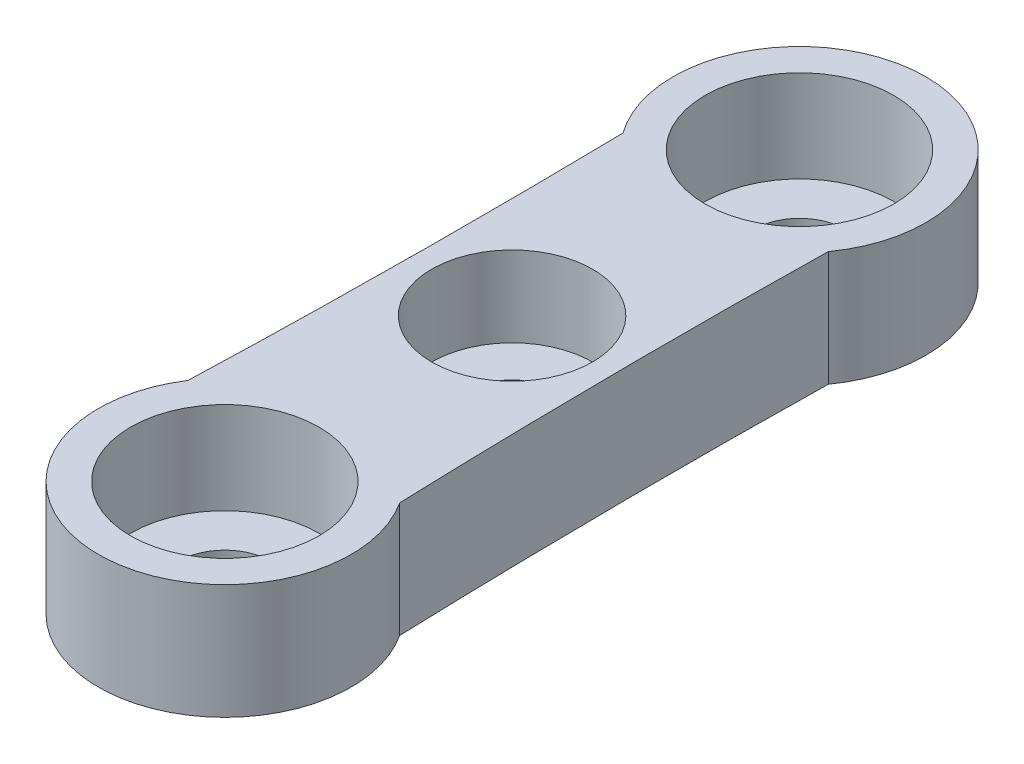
from build123d import *

# Parameters (mm, degrees)
SKETCH1_R           = 4.1
BOSS_EXTRUDE1_DEPTH = 5
SKETCH1_3_R         = 4.1
SKETCH1_3_R_2       = 2
BOSS_EXTRUDE2_DEPTH = 1
SKETCH4_R           = 1.525
CUT_EXTRUDE1_DEPTH  = 10
SKETCH6_R           = 3.5
CUT_EXTRUDE2_DEPTH  = 3.5


with BuildPart() as part:
    # Sketch1 → Boss-Extrude1 (new body)
    with BuildSketch(Plane(origin=(0, 0, 0), x_dir=(1, 0, 0), z_dir=(0, 1, 0))):
        with BuildLine():
            ThreePointArc((-4.608285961, -9.497717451), (0, -18), (4.608285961, -9.497717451))
            add(Edge.make_bspline(
                [(4.46618649, 9.29014358), (4.29282361, -0.10560008), (4.608285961, -9.497717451)],
                knots=[0, 0, 0, 1, 1, 1], degree=2))
            ThreePointArc((4.46618649, 9.29014358), (0, 18), (-4.46618649, 9.29014358))
            add(Edge.make_bspline(
                [(-4.46618649, 9.29014358), (-4.29282361, -0.10560008), (-4.608285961, -9.497717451)],
                knots=[0, 0, 0, 1, 1, 1], degree=2))
        make_face()
        with Locations(Location((0, -12.5, 0), (0, 0, 270))):
            Circle(SKETCH1_R, mode=Mode.SUBTRACT)
        with Locations(Location((0, 12.5, 0), (0, 0, 270))):
            Circle(SKETCH1_R, mode=Mode.SUBTRACT)
    extrude(amount=BOSS_EXTRUDE1_DEPTH)

    # Sketch1_3 → Boss-Extrude2 (add)
    # profile 1 of 2: a face of its own
    with BuildSketch(Plane(origin=(0, 0, 0), x_dir=(1, 0, 0), z_dir=(0, 1, 0))):
        with Locations(Location((0, -12.5, 0), (0, 0, 270))):
            Circle(SKETCH1_3_R)
        with Locations(Location((0, -12.5, 0), (0, 0, 270))):
            Circle(SKETCH1_3_R_2, mode=Mode.SUBTRACT)
    # profile 2 of 2: a face of its own
    with BuildSketch(Plane(origin=(0, 0, 0), x_dir=(1, 0, 0), z_dir=(0, 1, 0))):
        with Locations(Location((0, 12.5, 0), (0, 0, 270))):
            Circle(SKETCH1_3_R)
        with Locations(Location((0, 12.5, 0), (0, 0, 270))):
            Circle(SKETCH1_3_R_2, mode=Mode.SUBTRACT)
    extrude(amount=BOSS_EXTRUDE2_DEPTH)

    # Sketch4 → Cut-Extrude1 (cut)
    with BuildSketch(Plane.XZ):
        with Locations(Location((0, 0, 0), (0, 0, 270))):
            Circle(SKETCH4_R)
    extrude(amount=-CUT_EXTRUDE1_DEPTH, mode=Mode.SUBTRACT)

    # Sketch6 → Cut-Extrude2 (cut)
    with BuildSketch(Plane(origin=(0, 5, 0), x_dir=(1, 0, 0), z_dir=(0, 1, 0))):
        with Locations(Location((0, 0, 0), (0, 0, 270))):
            Circle(SKETCH6_R)
    extrude(amount=-CUT_EXTRUDE2_DEPTH, mode=Mode.SUBTRACT)


solid = part.part
